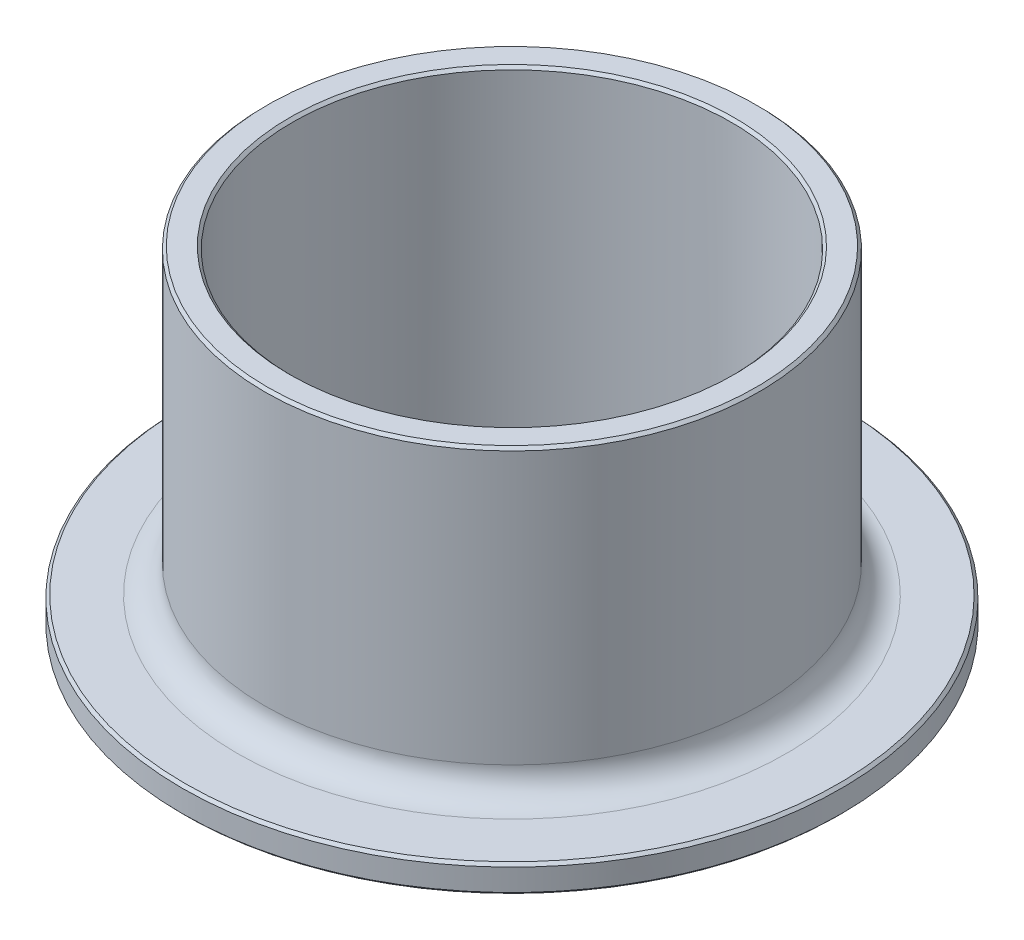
ISO-10303-21;
HEADER;
FILE_DESCRIPTION(('STEP AP214'),'2;1');
FILE_NAME('part.step','',(''),(''),'','','');
FILE_SCHEMA(('AUTOMOTIVE_DESIGN { 1 0 10303 214 1 1 1 1 }'));
ENDSEC;
DATA;
#1=APPLICATION_CONTEXT('core data for automotive mechanical design processes');
#2=APPLICATION_PROTOCOL_DEFINITION('international standard','automotive_design',2000,#1);
#3=PRODUCT_CONTEXT('',#1,'mechanical');
#4=PRODUCT('Part','Part','',(#3));
#5=PRODUCT_RELATED_PRODUCT_CATEGORY('part','',(#4));
#6=PRODUCT_DEFINITION_FORMATION('','',#4);
#7=PRODUCT_DEFINITION_CONTEXT('part definition',#1,'design');
#8=PRODUCT_DEFINITION('design','',#6,#7);
#9=PRODUCT_DEFINITION_SHAPE('','',#8);
#10=(LENGTH_UNIT() NAMED_UNIT(*) SI_UNIT(.MILLI.,.METRE.));
#11=(NAMED_UNIT(*) PLANE_ANGLE_UNIT() SI_UNIT($,.RADIAN.));
#12=(NAMED_UNIT(*) SI_UNIT($,.STERADIAN.) SOLID_ANGLE_UNIT());
#13=UNCERTAINTY_MEASURE_WITH_UNIT(LENGTH_MEASURE(1.E-05),#10,'distance_accuracy_value','');
#14=(GEOMETRIC_REPRESENTATION_CONTEXT(3) GLOBAL_UNCERTAINTY_ASSIGNED_CONTEXT((#13)) GLOBAL_UNIT_ASSIGNED_CONTEXT((#10,
#11,#12)) REPRESENTATION_CONTEXT('',''));
#15=CARTESIAN_POINT('',(0.,0.,0.));
#16=DIRECTION('',(0.,0.,1.));
#17=DIRECTION('',(1.,0.,0.));
#18=AXIS2_PLACEMENT_3D('',#15,#16,#17);
#19=CARTESIAN_POINT('',(0.,29.2448486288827,0.));
#20=DIRECTION('',(0.,1.,0.));
#21=DIRECTION('',(0.,0.,1.));
#22=AXIS2_PLACEMENT_3D('',#19,#20,#21);
#23=CYLINDRICAL_SURFACE('',#22,8.);
#24=CARTESIAN_POINT('',(0.,2.26276587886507,0.));
#25=DIRECTION('',(0.,-1.,0.));
#26=DIRECTION('',(0.,0.,-1.));
#27=AXIS2_PLACEMENT_3D('',#24,#25,#26);
#28=CIRCLE('',#27,8.);
#29=CARTESIAN_POINT('',(0.,2.26276587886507,-8.));
#30=VERTEX_POINT('',#29);
#31=EDGE_CURVE('E56',#30,#30,#28,.T.);
#32=ORIENTED_EDGE('',*,*,#31,.T.);
#33=EDGE_LOOP('',(#32));
#34=FACE_BOUND('',#33,.T.);
#35=CARTESIAN_POINT('',(0.,14.0627658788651,0.));
#36=DIRECTION('',(0.,1.,0.));
#37=DIRECTION('',(0.,0.,1.));
#38=AXIS2_PLACEMENT_3D('',#35,#36,#37);
#39=CIRCLE('',#38,8.);
#40=CARTESIAN_POINT('',(0.,14.0627658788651,8.));
#41=VERTEX_POINT('',#40);
#42=EDGE_CURVE('E59',#41,#41,#39,.T.);
#43=ORIENTED_EDGE('',*,*,#42,.T.);
#44=EDGE_LOOP('',(#43));
#45=FACE_BOUND('',#44,.T.);
#46=ADVANCED_FACE('F30',(#34,#45),#23,.F.);
#47=CARTESIAN_POINT('',(-12.,2.16276587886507,0.));
#48=DIRECTION('',(0.,-1.,0.));
#49=DIRECTION('',(0.,0.,-1.));
#50=AXIS2_PLACEMENT_3D('',#47,#48,#49);
#51=PLANE('',#50);
#52=CARTESIAN_POINT('',(0.,2.16276587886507,0.));
#53=DIRECTION('',(0.,-1.,0.));
#54=DIRECTION('',(0.,0.,-1.));
#55=AXIS2_PLACEMENT_3D('',#52,#53,#54);
#56=CIRCLE('',#55,8.1);
#57=CARTESIAN_POINT('',(0.,2.16276587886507,-8.1));
#58=VERTEX_POINT('',#57);
#59=EDGE_CURVE('E62',#58,#58,#56,.F.);
#60=ORIENTED_EDGE('',*,*,#59,.T.);
#61=EDGE_LOOP('',(#60));
#62=FACE_BOUND('',#61,.T.);
#63=CARTESIAN_POINT('',(0.,2.16276587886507,0.));
#64=DIRECTION('',(0.,-1.,0.));
#65=DIRECTION('',(0.,0.,-1.));
#66=AXIS2_PLACEMENT_3D('',#63,#64,#65);
#67=CIRCLE('',#66,11.9);
#68=CARTESIAN_POINT('',(0.,2.16276587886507,-11.9));
#69=VERTEX_POINT('',#68);
#70=EDGE_CURVE('E65',#69,#69,#67,.T.);
#71=ORIENTED_EDGE('',*,*,#70,.T.);
#72=EDGE_LOOP('',(#71));
#73=FACE_BOUND('',#72,.T.);
#74=ADVANCED_FACE('F94',(#62,#73),#51,.T.);
#75=CARTESIAN_POINT('',(0.,29.2448486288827,0.));
#76=DIRECTION('',(0.,1.,0.));
#77=DIRECTION('',(0.,0.,1.));
#78=AXIS2_PLACEMENT_3D('',#75,#76,#77);
#79=CYLINDRICAL_SURFACE('',#78,12.);
#80=CARTESIAN_POINT('',(0.,2.26276587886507,0.));
#81=DIRECTION('',(0.,-1.,0.));
#82=DIRECTION('',(0.,0.,-1.));
#83=AXIS2_PLACEMENT_3D('',#80,#81,#82);
#84=CIRCLE('',#83,12.);
#85=CARTESIAN_POINT('',(0.,2.26276587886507,-12.));
#86=VERTEX_POINT('',#85);
#87=EDGE_CURVE('E50',#86,#86,#84,.F.);
#88=ORIENTED_EDGE('',*,*,#87,.T.);
#89=EDGE_LOOP('',(#88));
#90=FACE_BOUND('',#89,.T.);
#91=CARTESIAN_POINT('',(0.,3.06276587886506,0.));
#92=DIRECTION('',(0.,1.,0.));
#93=DIRECTION('',(0.,0.,1.));
#94=AXIS2_PLACEMENT_3D('',#91,#92,#93);
#95=CIRCLE('',#94,12.);
#96=CARTESIAN_POINT('',(0.,3.06276587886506,12.));
#97=VERTEX_POINT('',#96);
#98=EDGE_CURVE('E53',#97,#97,#95,.F.);
#99=ORIENTED_EDGE('',*,*,#98,.T.);
#100=EDGE_LOOP('',(#99));
#101=FACE_BOUND('',#100,.T.);
#102=ADVANCED_FACE('F99',(#90,#101),#79,.T.);
#103=CARTESIAN_POINT('',(-9.,3.16276587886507,0.));
#104=DIRECTION('',(0.,1.,0.));
#105=DIRECTION('',(0.,0.,1.));
#106=AXIS2_PLACEMENT_3D('',#103,#104,#105);
#107=PLANE('',#106);
#108=CARTESIAN_POINT('',(0.,3.16276587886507,0.));
#109=DIRECTION('',(0.,1.,0.));
#110=DIRECTION('',(0.,0.,1.));
#111=AXIS2_PLACEMENT_3D('',#108,#109,#110);
#112=CIRCLE('',#111,11.9);
#113=CARTESIAN_POINT('',(0.,3.16276587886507,11.9));
#114=VERTEX_POINT('',#113);
#115=EDGE_CURVE('E45',#114,#114,#112,.T.);
#116=ORIENTED_EDGE('',*,*,#115,.T.);
#117=EDGE_LOOP('',(#116));
#118=FACE_BOUND('',#117,.T.);
#119=CARTESIAN_POINT('',(0.,3.16276587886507,0.));
#120=DIRECTION('',(0.,1.,0.));
#121=DIRECTION('',(0.,0.,1.));
#122=AXIS2_PLACEMENT_3D('',#119,#120,#121);
#123=CIRCLE('',#122,10.);
#124=CARTESIAN_POINT('',(0.,3.16276587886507,10.));
#125=VERTEX_POINT('',#124);
#126=EDGE_CURVE('E68',#125,#125,#123,.F.);
#127=ORIENTED_EDGE('',*,*,#126,.T.);
#128=EDGE_LOOP('',(#127));
#129=FACE_BOUND('',#128,.T.);
#130=ADVANCED_FACE('F106',(#118,#129),#107,.T.);
#131=CARTESIAN_POINT('',(0.,29.2448486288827,0.));
#132=DIRECTION('',(0.,1.,0.));
#133=DIRECTION('',(0.,0.,1.));
#134=AXIS2_PLACEMENT_3D('',#131,#132,#133);
#135=CYLINDRICAL_SURFACE('',#134,9.);
#136=CARTESIAN_POINT('',(0.,14.0627658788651,0.));
#137=DIRECTION('',(0.,1.,0.));
#138=DIRECTION('',(0.,0.,1.));
#139=AXIS2_PLACEMENT_3D('',#136,#137,#138);
#140=CIRCLE('',#139,9.);
#141=CARTESIAN_POINT('',(0.,14.0627658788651,9.));
#142=VERTEX_POINT('',#141);
#143=EDGE_CURVE('E10',#142,#142,#140,.F.);
#144=ORIENTED_EDGE('',*,*,#143,.T.);
#145=EDGE_LOOP('',(#144));
#146=FACE_BOUND('',#145,.T.);
#147=CARTESIAN_POINT('',(0.,4.16276587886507,0.));
#148=DIRECTION('',(0.,1.,0.));
#149=DIRECTION('',(0.,0.,1.));
#150=AXIS2_PLACEMENT_3D('',#147,#148,#149);
#151=CIRCLE('',#150,9.);
#152=CARTESIAN_POINT('',(0.,4.16276587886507,9.));
#153=VERTEX_POINT('',#152);
#154=EDGE_CURVE('E71',#153,#153,#151,.T.);
#155=ORIENTED_EDGE('',*,*,#154,.T.);
#156=EDGE_LOOP('',(#155));
#157=FACE_BOUND('',#156,.T.);
#158=ADVANCED_FACE('F75',(#146,#157),#135,.T.);
#159=CARTESIAN_POINT('',(-8.,14.1627658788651,0.));
#160=DIRECTION('',(0.,1.,0.));
#161=DIRECTION('',(0.,0.,1.));
#162=AXIS2_PLACEMENT_3D('',#159,#160,#161);
#163=PLANE('',#162);
#164=CARTESIAN_POINT('',(0.,14.1627658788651,0.));
#165=DIRECTION('',(0.,1.,0.));
#166=DIRECTION('',(0.,0.,1.));
#167=AXIS2_PLACEMENT_3D('',#164,#165,#166);
#168=CIRCLE('',#167,8.9);
#169=CARTESIAN_POINT('',(0.,14.1627658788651,8.9));
#170=VERTEX_POINT('',#169);
#171=EDGE_CURVE('E37',#170,#170,#168,.T.);
#172=ORIENTED_EDGE('',*,*,#171,.T.);
#173=EDGE_LOOP('',(#172));
#174=FACE_BOUND('',#173,.T.);
#175=CARTESIAN_POINT('',(0.,14.1627658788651,0.));
#176=DIRECTION('',(0.,1.,0.));
#177=DIRECTION('',(0.,0.,1.));
#178=AXIS2_PLACEMENT_3D('',#175,#176,#177);
#179=CIRCLE('',#178,8.1);
#180=CARTESIAN_POINT('',(0.,14.1627658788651,8.1));
#181=VERTEX_POINT('',#180);
#182=EDGE_CURVE('E41',#181,#181,#179,.F.);
#183=ORIENTED_EDGE('',*,*,#182,.T.);
#184=EDGE_LOOP('',(#183));
#185=FACE_BOUND('',#184,.T.);
#186=ADVANCED_FACE('F80',(#174,#185),#163,.T.);
#187=CARTESIAN_POINT('',(0.,4.16276587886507,0.));
#188=DIRECTION('',(0.,1.,0.));
#189=DIRECTION('',(0.,0.,1.));
#190=AXIS2_PLACEMENT_3D('',#187,#188,#189);
#191=TOROIDAL_SURFACE('',#190,10.,1.);
#192=ORIENTED_EDGE('',*,*,#126,.F.);
#193=EDGE_LOOP('',(#192));
#194=FACE_BOUND('',#193,.T.);
#195=ORIENTED_EDGE('',*,*,#154,.F.);
#196=EDGE_LOOP('',(#195));
#197=FACE_BOUND('',#196,.T.);
#198=ADVANCED_FACE('F77',(#194,#197),#191,.F.);
#199=CARTESIAN_POINT('',(0.,2.16276587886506,0.));
#200=DIRECTION('',(0.,-1.,0.));
#201=DIRECTION('',(0.,0.,-1.));
#202=AXIS2_PLACEMENT_3D('',#199,#200,#201);
#203=CONICAL_SURFACE('',#202,8.1,0.785398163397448);
#204=ORIENTED_EDGE('',*,*,#31,.F.);
#205=EDGE_LOOP('',(#204));
#206=FACE_BOUND('',#205,.T.);
#207=ORIENTED_EDGE('',*,*,#59,.F.);
#208=EDGE_LOOP('',(#207));
#209=FACE_BOUND('',#208,.T.);
#210=ADVANCED_FACE('F79',(#206,#209),#203,.F.);
#211=CARTESIAN_POINT('',(0.,2.26276587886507,0.));
#212=DIRECTION('',(0.,1.,0.));
#213=DIRECTION('',(0.,0.,1.));
#214=AXIS2_PLACEMENT_3D('',#211,#212,#213);
#215=CONICAL_SURFACE('',#214,12.,0.78539816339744);
#216=ORIENTED_EDGE('',*,*,#70,.F.);
#217=EDGE_LOOP('',(#216));
#218=FACE_BOUND('',#217,.T.);
#219=ORIENTED_EDGE('',*,*,#87,.F.);
#220=EDGE_LOOP('',(#219));
#221=FACE_BOUND('',#220,.T.);
#222=ADVANCED_FACE('F87',(#218,#221),#215,.T.);
#223=CARTESIAN_POINT('',(0.,3.16276587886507,0.));
#224=DIRECTION('',(0.,-1.,0.));
#225=DIRECTION('',(0.,0.,-1.));
#226=AXIS2_PLACEMENT_3D('',#223,#224,#225);
#227=CONICAL_SURFACE('',#226,11.9,0.785398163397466);
#228=ORIENTED_EDGE('',*,*,#98,.F.);
#229=EDGE_LOOP('',(#228));
#230=FACE_BOUND('',#229,.T.);
#231=ORIENTED_EDGE('',*,*,#115,.F.);
#232=EDGE_LOOP('',(#231));
#233=FACE_BOUND('',#232,.T.);
#234=ADVANCED_FACE('F136',(#230,#233),#227,.T.);
#235=CARTESIAN_POINT('',(0.,14.1627658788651,0.));
#236=DIRECTION('',(0.,-1.,0.));
#237=DIRECTION('',(0.,0.,-1.));
#238=AXIS2_PLACEMENT_3D('',#235,#236,#237);
#239=CONICAL_SURFACE('',#238,8.9,0.785398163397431);
#240=ORIENTED_EDGE('',*,*,#143,.F.);
#241=EDGE_LOOP('',(#240));
#242=FACE_BOUND('',#241,.T.);
#243=ORIENTED_EDGE('',*,*,#171,.F.);
#244=EDGE_LOOP('',(#243));
#245=FACE_BOUND('',#244,.T.);
#246=ADVANCED_FACE('F146',(#242,#245),#239,.T.);
#247=CARTESIAN_POINT('',(0.,14.0627658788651,0.));
#248=DIRECTION('',(0.,1.,0.));
#249=DIRECTION('',(0.,0.,1.));
#250=AXIS2_PLACEMENT_3D('',#247,#248,#249);
#251=CONICAL_SURFACE('',#250,8.,0.785398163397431);
#252=ORIENTED_EDGE('',*,*,#182,.F.);
#253=EDGE_LOOP('',(#252));
#254=FACE_BOUND('',#253,.T.);
#255=ORIENTED_EDGE('',*,*,#42,.F.);
#256=EDGE_LOOP('',(#255));
#257=FACE_BOUND('',#256,.T.);
#258=ADVANCED_FACE('F32',(#254,#257),#251,.F.);
#259=CLOSED_SHELL('',(#46,#74,#102,#130,#158,#186,#198,#210,#222,#234,#246,#258));
#260=MANIFOLD_SOLID_BREP('B2',#259);
#261=ADVANCED_BREP_SHAPE_REPRESENTATION('',(#18,#260),#14);
#262=SHAPE_DEFINITION_REPRESENTATION(#9,#261);
ENDSEC;
END-ISO-10303-21;
